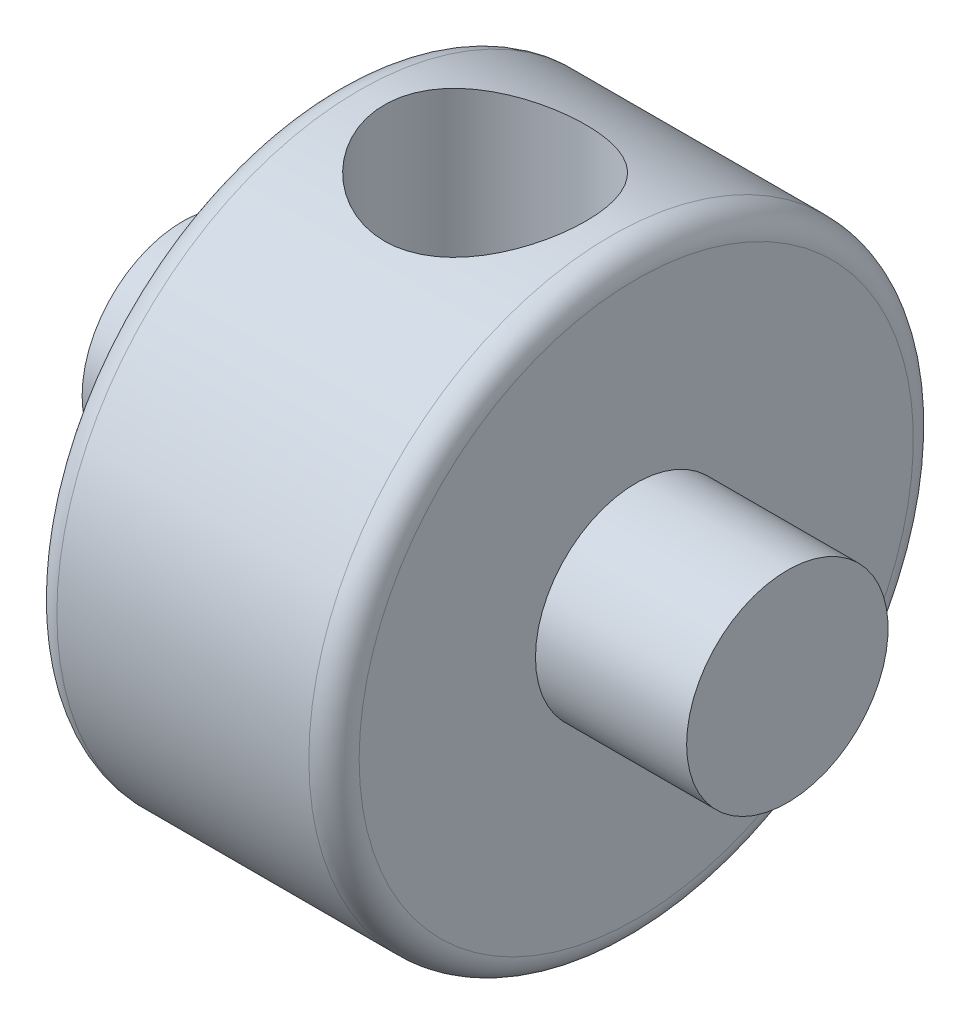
ISO-10303-21;
HEADER;
FILE_DESCRIPTION(('STEP AP214'),'2;1');
FILE_NAME('part.step','',(''),(''),'','','');
FILE_SCHEMA(('AUTOMOTIVE_DESIGN { 1 0 10303 214 1 1 1 1 }'));
ENDSEC;
DATA;
#1=APPLICATION_CONTEXT('core data for automotive mechanical design processes');
#2=APPLICATION_PROTOCOL_DEFINITION('international standard','automotive_design',2000,#1);
#3=PRODUCT_CONTEXT('',#1,'mechanical');
#4=PRODUCT('Part','Part','',(#3));
#5=PRODUCT_RELATED_PRODUCT_CATEGORY('part','',(#4));
#6=PRODUCT_DEFINITION_FORMATION('','',#4);
#7=PRODUCT_DEFINITION_CONTEXT('part definition',#1,'design');
#8=PRODUCT_DEFINITION('design','',#6,#7);
#9=PRODUCT_DEFINITION_SHAPE('','',#8);
#10=(LENGTH_UNIT() NAMED_UNIT(*) SI_UNIT(.MILLI.,.METRE.));
#11=(NAMED_UNIT(*) PLANE_ANGLE_UNIT() SI_UNIT($,.RADIAN.));
#12=(NAMED_UNIT(*) SI_UNIT($,.STERADIAN.) SOLID_ANGLE_UNIT());
#13=UNCERTAINTY_MEASURE_WITH_UNIT(LENGTH_MEASURE(1.E-05),#10,'distance_accuracy_value','');
#14=(GEOMETRIC_REPRESENTATION_CONTEXT(3) GLOBAL_UNCERTAINTY_ASSIGNED_CONTEXT((#13)) GLOBAL_UNIT_ASSIGNED_CONTEXT((#10,
#11,#12)) REPRESENTATION_CONTEXT('',''));
#15=CARTESIAN_POINT('',(0.,0.,0.));
#16=DIRECTION('',(0.,0.,1.));
#17=DIRECTION('',(1.,0.,0.));
#18=AXIS2_PLACEMENT_3D('',#15,#16,#17);
#19=CARTESIAN_POINT('',(-9.52499999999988,0.,0.));
#20=DIRECTION('',(1.,0.,0.));
#21=DIRECTION('',(0.,0.,-1.));
#22=AXIS2_PLACEMENT_3D('',#19,#20,#21);
#23=PLANE('',#22);
#24=CARTESIAN_POINT('',(-9.52499999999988,0.,0.));
#25=DIRECTION('',(-1.,0.,0.));
#26=DIRECTION('',(0.,0.,1.));
#27=AXIS2_PLACEMENT_3D('',#24,#25,#26);
#28=CIRCLE('',#27,3.175);
#29=CARTESIAN_POINT('',(-9.52499999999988,0.,3.175));
#30=VERTEX_POINT('',#29);
#31=EDGE_CURVE('E112',#30,#30,#28,.T.);
#32=ORIENTED_EDGE('',*,*,#31,.T.);
#33=EDGE_LOOP('',(#32));
#34=FACE_BOUND('',#33,.T.);
#35=ADVANCED_FACE('F36',(#34),#23,.F.);
#36=CARTESIAN_POINT('',(-58.3897157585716,0.,-1.2490009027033E-13));
#37=DIRECTION('',(-1.,0.,0.));
#38=DIRECTION('',(0.,0.,1.));
#39=AXIS2_PLACEMENT_3D('',#36,#37,#38);
#40=CYLINDRICAL_SURFACE('',#39,3.175);
#41=ORIENTED_EDGE('',*,*,#31,.F.);
#42=EDGE_LOOP('',(#41));
#43=FACE_BOUND('',#42,.T.);
#44=CARTESIAN_POINT('',(-4.76249999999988,0.,0.));
#45=DIRECTION('',(-1.,0.,0.));
#46=DIRECTION('',(0.,0.,1.));
#47=AXIS2_PLACEMENT_3D('',#44,#45,#46);
#48=CIRCLE('',#47,3.175);
#49=CARTESIAN_POINT('',(-4.76249999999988,0.,3.175));
#50=VERTEX_POINT('',#49);
#51=EDGE_CURVE('E116',#50,#50,#48,.T.);
#52=ORIENTED_EDGE('',*,*,#51,.T.);
#53=EDGE_LOOP('',(#52));
#54=FACE_BOUND('',#53,.T.);
#55=ADVANCED_FACE('F89',(#43,#54),#40,.T.);
#56=CARTESIAN_POINT('',(-4.76249999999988,3.17500000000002,0.));
#57=DIRECTION('',(1.,0.,0.));
#58=DIRECTION('',(0.,0.,-1.));
#59=AXIS2_PLACEMENT_3D('',#56,#57,#58);
#60=PLANE('',#59);
#61=CARTESIAN_POINT('',(-4.76249999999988,0.,0.));
#62=DIRECTION('',(1.,0.,0.));
#63=DIRECTION('',(0.,0.,-1.));
#64=AXIS2_PLACEMENT_3D('',#61,#62,#63);
#65=CIRCLE('',#64,8.73252);
#66=CARTESIAN_POINT('',(-4.76249999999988,0.,-8.73252));
#67=VERTEX_POINT('',#66);
#68=EDGE_CURVE('E109',#67,#67,#65,.F.);
#69=ORIENTED_EDGE('',*,*,#68,.T.);
#70=EDGE_LOOP('',(#69));
#71=FACE_BOUND('',#70,.T.);
#72=ORIENTED_EDGE('',*,*,#51,.F.);
#73=EDGE_LOOP('',(#72));
#74=FACE_BOUND('',#73,.T.);
#75=ADVANCED_FACE('F86',(#71,#74),#60,.F.);
#76=CARTESIAN_POINT('',(-58.3897157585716,0.,-1.2490009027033E-13));
#77=DIRECTION('',(-1.,0.,0.));
#78=DIRECTION('',(0.,0.,1.));
#79=AXIS2_PLACEMENT_3D('',#76,#77,#78);
#80=CYLINDRICAL_SURFACE('',#79,9.525);
#81=CARTESIAN_POINT('',(-3.17499999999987,-9.52500000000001,0.));
#82=CARTESIAN_POINT('',(-3.17500080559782,-9.52500048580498,0.17323867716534));
#83=CARTESIAN_POINT('',(-3.16077515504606,-9.52023018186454,0.346472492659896));
#84=CARTESIAN_POINT('',(-3.10442257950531,-9.50167042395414,0.687837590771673));
#85=CARTESIAN_POINT('',(-3.06229275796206,-9.48788003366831,0.855968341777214));
#86=CARTESIAN_POINT('',(-2.9517364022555,-9.45277852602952,1.18215660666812));
#87=CARTESIAN_POINT('',(-2.88335382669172,-9.43147998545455,1.34023044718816));
#88=CARTESIAN_POINT('',(-2.72243177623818,-9.38353615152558,1.64266542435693));
#89=CARTESIAN_POINT('',(-2.62988753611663,-9.35688980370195,1.7870238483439));
#90=CARTESIAN_POINT('',(-2.41990306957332,-9.30002249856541,2.06292981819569));
#91=CARTESIAN_POINT('',(-2.30177583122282,-9.26971591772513,2.19393674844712));
#92=CARTESIAN_POINT('',(-2.04543928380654,-9.20941499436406,2.43469379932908));
#93=CARTESIAN_POINT('',(-1.90722556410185,-9.17942072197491,2.544439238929));
#94=CARTESIAN_POINT('',(-1.60977225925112,-9.12219830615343,2.74264419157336));
#95=CARTESIAN_POINT('',(-1.4500423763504,-9.09507449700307,2.83040092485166));
#96=CARTESIAN_POINT('',(-1.11704090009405,-9.04796594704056,2.9775749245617));
#97=CARTESIAN_POINT('',(-0.943773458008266,-9.02797902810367,3.037000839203));
#98=CARTESIAN_POINT('',(-0.594762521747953,-8.99830887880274,3.12379824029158));
#99=CARTESIAN_POINT('',(-0.419299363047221,-8.98830104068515,3.15218269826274));
#100=CARTESIAN_POINT('',(-0.0658375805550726,-8.97876209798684,3.17925806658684));
#101=CARTESIAN_POINT('',(0.112160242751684,-8.97922775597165,3.17795815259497));
#102=CARTESIAN_POINT('',(0.456998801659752,-8.99029872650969,3.14648819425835));
#103=CARTESIAN_POINT('',(0.623977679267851,-9.00043970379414,3.11764017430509));
#104=CARTESIAN_POINT('',(0.950574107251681,-9.02895888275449,3.03404956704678));
#105=CARTESIAN_POINT('',(1.11019077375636,-9.04733807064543,2.97930387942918));
#106=CARTESIAN_POINT('',(1.42053547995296,-9.09059367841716,2.84460650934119));
#107=CARTESIAN_POINT('',(1.57107898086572,-9.11556996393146,2.76426310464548));
#108=CARTESIAN_POINT('',(1.8569651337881,-9.16916373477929,2.58092291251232));
#109=CARTESIAN_POINT('',(1.99230337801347,-9.19778227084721,2.4779195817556));
#110=CARTESIAN_POINT('',(2.25136582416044,-9.25726270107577,2.245834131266));
#111=CARTESIAN_POINT('',(2.37411480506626,-9.28816371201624,2.11567125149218));
#112=CARTESIAN_POINT('',(2.59629677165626,-9.3474202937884,1.83622813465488));
#113=CARTESIAN_POINT('',(2.69572752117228,-9.37577562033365,1.68694606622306));
#114=CARTESIAN_POINT('',(2.86923575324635,-9.42711817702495,1.37143367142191));
#115=CARTESIAN_POINT('',(2.94305193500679,-9.45004936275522,1.20504990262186));
#116=CARTESIAN_POINT('',(3.06134507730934,-9.48755300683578,0.861279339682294));
#117=CARTESIAN_POINT('',(3.1058322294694,-9.50212836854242,0.683896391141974));
#118=CARTESIAN_POINT('',(3.162476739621,-9.52079715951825,0.331418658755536));
#119=CARTESIAN_POINT('',(3.17595189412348,-9.52531755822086,0.156557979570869));
#120=CARTESIAN_POINT('',(3.17394376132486,-9.52464766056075,-0.192960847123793));
#121=CARTESIAN_POINT('',(3.1584653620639,-9.51945900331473,-0.367619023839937));
#122=CARTESIAN_POINT('',(3.10003219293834,-9.50023578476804,-0.706500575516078));
#123=CARTESIAN_POINT('',(3.05788629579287,-9.48646180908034,-0.870879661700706));
#124=CARTESIAN_POINT('',(2.94832581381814,-9.45171613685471,-1.19016766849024));
#125=CARTESIAN_POINT('',(2.88090800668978,-9.43074352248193,-1.34507537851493));
#126=CARTESIAN_POINT('',(2.72075137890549,-9.38304356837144,-1.64556534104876));
#127=CARTESIAN_POINT('',(2.62739316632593,-9.35617936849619,-1.79079512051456));
#128=CARTESIAN_POINT('',(2.4187335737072,-9.29974181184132,-2.0639558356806));
#129=CARTESIAN_POINT('',(2.30342549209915,-9.27016762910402,-2.19188146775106));
#130=CARTESIAN_POINT('',(2.0479424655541,-9.20993992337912,-2.43285171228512));
#131=CARTESIAN_POINT('',(1.90687570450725,-9.17929841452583,-2.54495607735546));
#132=CARTESIAN_POINT('',(1.60727527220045,-9.12177415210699,-2.74401763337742));
#133=CARTESIAN_POINT('',(1.44874145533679,-9.09489142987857,-2.83097461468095));
#134=CARTESIAN_POINT('',(1.11863817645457,-9.04819093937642,-2.97687025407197));
#135=CARTESIAN_POINT('',(0.947095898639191,-9.02835890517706,-3.03586556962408));
#136=CARTESIAN_POINT('',(0.595697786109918,-8.99829392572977,-3.12386556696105));
#137=CARTESIAN_POINT('',(0.415845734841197,-8.98805665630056,-3.15288375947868));
#138=CARTESIAN_POINT('',(0.0628742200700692,-8.97883201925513,-3.1790521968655));
#139=CARTESIAN_POINT('',(-0.110116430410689,-8.97929370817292,-3.17776306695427));
#140=CARTESIAN_POINT('',(-0.453279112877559,-8.99005281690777,-3.14719428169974));
#141=CARTESIAN_POINT('',(-0.623451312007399,-9.00034965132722,-3.11791629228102));
#142=CARTESIAN_POINT('',(-0.952930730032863,-9.02920864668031,-3.03330550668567));
#143=CARTESIAN_POINT('',(-1.11238291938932,-9.04761011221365,-2.97847812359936));
#144=CARTESIAN_POINT('',(-1.41994701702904,-9.09054566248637,-2.8447344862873));
#145=CARTESIAN_POINT('',(-1.56805639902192,-9.11508110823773,-2.76581288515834));
#146=CARTESIAN_POINT('',(-1.85573565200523,-9.16885482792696,-2.58210269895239));
#147=CARTESIAN_POINT('',(-1.9946508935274,-9.19825159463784,-2.47633567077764));
#148=CARTESIAN_POINT('',(-2.25326515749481,-9.25777156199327,-2.24359115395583));
#149=CARTESIAN_POINT('',(-2.37295872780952,-9.28789496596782,-2.11660766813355));
#150=CARTESIAN_POINT('',(-2.59443350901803,-9.34688346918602,-1.83909194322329));
#151=CARTESIAN_POINT('',(-2.69533480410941,-9.37565377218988,-1.68783480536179));
#152=CARTESIAN_POINT('',(-2.87016961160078,-9.42740021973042,-1.36955960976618));
#153=CARTESIAN_POINT('',(-2.94411001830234,-9.45037784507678,-1.2025455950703));
#154=CARTESIAN_POINT('',(-3.05981618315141,-9.48707510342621,-0.865167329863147));
#155=CARTESIAN_POINT('',(-3.10287183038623,-9.50116249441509,-0.695286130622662));
#156=CARTESIAN_POINT('',(-3.16045939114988,-9.52012342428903,-0.350267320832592));
#157=CARTESIAN_POINT('',(-3.17499918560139,-9.52499950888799,-0.175131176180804));
#158=CARTESIAN_POINT('',(-3.17499999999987,-9.52500000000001,0.));
#159=B_SPLINE_CURVE_WITH_KNOTS('',3,(#81,#82,#83,#84,#85,#86,#87,#88,#89,#90,#91,#92,#93,#94,
#95,#96,#97,#98,#99,#100,#101,#102,#103,#104,#105,#106,#107,#108,#109,#110,#111,#112,#113,#114,
#115,#116,#117,#118,#119,#120,#121,#122,#123,#124,#125,#126,#127,#128,#129,#130,#131,#132,#133,
#134,#135,#136,#137,#138,#139,#140,#141,#142,#143,#144,#145,#146,#147,#148,#149,#150,#151,#152,
#153,#154,#155,#156,#157,#158),.UNSPECIFIED.,.T.,.F.,(4,2,2,2,2,2,2,2,2,2,2,2,2,2,2,2,2,2,2,2,2,
2,2,2,2,2,2,2,2,2,2,2,2,2,2,2,2,2,4),(0.,0.519071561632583,1.03819701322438,1.55645698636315,
2.07481924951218,2.60936372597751,3.14402575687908,3.69406121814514,4.24392866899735,
4.7752611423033,5.30642937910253,5.81332424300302,6.32027980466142,6.83539943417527,
7.35066800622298,7.89283745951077,8.43505888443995,8.98265937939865,9.53006948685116,
10.0537512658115,10.5773446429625,11.0857715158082,11.5942632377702,12.1161301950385,
12.638156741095,13.1839024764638,13.729652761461,14.2742924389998,14.8186865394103,
15.3351123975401,15.8515075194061,16.3580948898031,16.8647947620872,17.3936046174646,
17.9225642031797,18.4721392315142,19.0215736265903,19.5464607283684,20.0712027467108),.UNSPECIFIED.);
#160=CARTESIAN_POINT('',(-3.17499999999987,-9.52500000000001,0.));
#161=VERTEX_POINT('',#160);
#162=EDGE_CURVE('E10',#161,#161,#159,.T.);
#163=ORIENTED_EDGE('',*,*,#162,.T.);
#164=EDGE_LOOP('',(#163));
#165=FACE_BOUND('',#164,.T.);
#166=CARTESIAN_POINT('',(0.,8.98025612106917,3.175));
#167=CARTESIAN_POINT('',(-0.172936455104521,8.98025555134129,3.17500081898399));
#168=CARTESIAN_POINT('',(-0.345867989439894,8.98530617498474,3.16082293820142));
#169=CARTESIAN_POINT('',(-0.686607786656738,9.00485797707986,3.10467734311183));
#170=CARTESIAN_POINT('',(-0.854415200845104,9.01936071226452,3.0627050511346));
#171=CARTESIAN_POINT('',(-1.17991538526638,9.05599546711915,2.95260866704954));
#172=CARTESIAN_POINT('',(-1.33762727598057,9.07811252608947,2.88453582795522));
#173=CARTESIAN_POINT('',(-1.63944315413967,9.12746212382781,2.7243456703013));
#174=CARTESIAN_POINT('',(-1.78354412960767,9.15469579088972,2.63222304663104));
#175=CARTESIAN_POINT('',(-2.05968588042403,9.2124050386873,2.42268738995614));
#176=CARTESIAN_POINT('',(-2.19111648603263,9.24296141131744,2.30449228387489));
#177=CARTESIAN_POINT('',(-2.4327065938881,9.30319020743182,2.04783584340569));
#178=CARTESIAN_POINT('',(-2.54286268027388,9.33286248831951,1.90937126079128));
#179=CARTESIAN_POINT('',(-2.74154549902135,9.3889152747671,1.61164431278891));
#180=CARTESIAN_POINT('',(-2.82943290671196,9.41518969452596,1.45193356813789));
#181=CARTESIAN_POINT('',(-2.97685328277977,9.46053437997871,1.11896913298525));
#182=CARTESIAN_POINT('',(-3.03639389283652,9.47960658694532,0.945719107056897));
#183=CARTESIAN_POINT('',(-3.12336133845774,9.50782564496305,0.596991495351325));
#184=CARTESIAN_POINT('',(-3.15183344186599,9.51729474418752,0.421801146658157));
#185=CARTESIAN_POINT('',(-3.17917923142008,9.52638456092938,0.0688907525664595));
#186=CARTESIAN_POINT('',(-3.17806054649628,9.52600781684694,-0.108828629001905));
#187=CARTESIAN_POINT('',(-3.14691949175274,9.51566675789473,-0.454353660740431));
#188=CARTESIAN_POINT('',(-3.11803247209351,9.50607905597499,-0.622274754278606));
#189=CARTESIAN_POINT('',(-3.034052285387,9.4788662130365,-0.950732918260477));
#190=CARTESIAN_POINT('',(-2.97895734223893,9.46124052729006,-1.11126948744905));
#191=CARTESIAN_POINT('',(-2.84346231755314,9.41945253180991,-1.42288410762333));
#192=CARTESIAN_POINT('',(-2.76273914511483,9.39520735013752,-1.57381010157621));
#193=CARTESIAN_POINT('',(-2.57854543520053,9.34270397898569,-1.86030973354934));
#194=CARTESIAN_POINT('',(-2.47506857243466,9.31444467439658,-1.99587908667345));
#195=CARTESIAN_POINT('',(-2.24258380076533,9.25532159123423,-2.25457025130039));
#196=CARTESIAN_POINT('',(-2.11260322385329,9.22439783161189,-2.37680549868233));
#197=CARTESIAN_POINT('',(-1.83372529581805,9.16455289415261,-2.59803029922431));
#198=CARTESIAN_POINT('',(-1.68482503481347,9.13563202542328,-2.6970162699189));
#199=CARTESIAN_POINT('',(-1.36952473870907,9.08273917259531,-2.87016016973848));
#200=CARTESIAN_POINT('',(-1.20290548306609,9.05884361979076,-2.94394402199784));
#201=CARTESIAN_POINT('',(-0.858610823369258,9.01959241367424,-3.06210713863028));
#202=CARTESIAN_POINT('',(-0.680940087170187,9.00423318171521,-3.1064987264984));
#203=CARTESIAN_POINT('',(-0.328173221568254,8.98460345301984,-3.16281207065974));
#204=CARTESIAN_POINT('',(-0.153322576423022,8.97986394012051,-3.17610837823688));
#205=CARTESIAN_POINT('',(0.196139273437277,8.98069933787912,-3.17374726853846));
#206=CARTESIAN_POINT('',(0.370750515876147,8.98627237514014,-3.158095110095));
#207=CARTESIAN_POINT('',(0.708523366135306,9.00663737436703,-3.09951644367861));
#208=CARTESIAN_POINT('',(0.871872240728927,9.0211060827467,-3.05754530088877));
#209=CARTESIAN_POINT('',(1.18917594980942,9.05727657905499,-2.94866651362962));
#210=CARTESIAN_POINT('',(1.34312911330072,9.07897964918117,-2.88175444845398));
#211=CARTESIAN_POINT('',(1.64268283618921,9.12802586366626,-2.72248103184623));
#212=CARTESIAN_POINT('',(1.78786359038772,9.15552606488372,-2.62937980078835));
#213=CARTESIAN_POINT('',(2.06103871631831,9.21276315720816,-2.42120937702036));
#214=CARTESIAN_POINT('',(2.18902800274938,9.24250070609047,-2.30613370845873));
#215=CARTESIAN_POINT('',(2.43055134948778,9.30259247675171,-2.05070616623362));
#216=CARTESIAN_POINT('',(2.54309368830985,9.33290753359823,-1.90940458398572));
#217=CARTESIAN_POINT('',(2.74293375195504,9.38932753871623,-1.60917665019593));
#218=CARTESIAN_POINT('',(2.83023237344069,9.41543263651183,-1.45025092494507));
#219=CARTESIAN_POINT('',(2.97630883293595,9.46036988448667,-1.12007606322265));
#220=CARTESIAN_POINT('',(3.03527230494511,9.47924920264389,-0.948915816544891));
#221=CARTESIAN_POINT('',(3.12333558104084,9.50781089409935,-0.598355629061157));
#222=CARTESIAN_POINT('',(3.1524461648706,9.5174965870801,-0.418958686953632));
#223=CARTESIAN_POINT('',(3.1790070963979,9.52632915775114,-0.0660886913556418));
#224=CARTESIAN_POINT('',(3.17788116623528,9.5259499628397,0.107266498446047));
#225=CARTESIAN_POINT('',(3.14751304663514,9.5158622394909,0.451202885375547));
#226=CARTESIAN_POINT('',(3.11827313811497,9.50615446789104,0.621784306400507));
#227=CARTESIAN_POINT('',(3.03345140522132,9.47867404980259,0.952633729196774));
#228=CARTESIAN_POINT('',(2.9782953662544,9.46103195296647,1.11302251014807));
#229=CARTESIAN_POINT('',(2.84360133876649,9.41949985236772,1.4223312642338));
#230=CARTESIAN_POINT('',(2.76405893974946,9.39560871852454,1.57124915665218));
#231=CARTESIAN_POINT('',(2.57946679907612,9.34294133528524,1.85938800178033));
#232=CARTESIAN_POINT('',(2.47358317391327,9.31401720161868,1.99804734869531));
#233=CARTESIAN_POINT('',(2.24073278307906,9.25490239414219,2.25609475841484));
#234=CARTESIAN_POINT('',(2.11375929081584,9.22471131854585,2.37547664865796));
#235=CARTESIAN_POINT('',(1.83639029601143,9.16505913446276,2.59633024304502));
#236=CARTESIAN_POINT('',(1.68527250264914,9.13567286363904,2.69691791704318));
#237=CARTESIAN_POINT('',(1.36736319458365,9.08241113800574,2.87119803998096));
#238=CARTESIAN_POINT('',(1.20057578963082,9.05853424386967,2.94489751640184));
#239=CARTESIAN_POINT('',(0.863721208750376,9.02021736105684,3.06020415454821));
#240=CARTESIAN_POINT('',(0.694143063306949,9.00539959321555,3.1031113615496));
#241=CARTESIAN_POINT('',(0.3497070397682,8.98542092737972,3.1605039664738));
#242=CARTESIAN_POINT('',(0.174851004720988,8.98025669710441,3.17499917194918));
#243=CARTESIAN_POINT('',(0.,8.98025612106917,3.175));
#244=B_SPLINE_CURVE_WITH_KNOTS('',3,(#166,#167,#168,#169,#170,#171,#172,#173,#174,#175,#176,
#177,#178,#179,#180,#181,#182,#183,#184,#185,#186,#187,#188,#189,#190,#191,#192,#193,#194,#195,
#196,#197,#198,#199,#200,#201,#202,#203,#204,#205,#206,#207,#208,#209,#210,#211,#212,#213,#214,
#215,#216,#217,#218,#219,#220,#221,#222,#223,#224,#225,#226,#227,#228,#229,#230,#231,#232,#233,
#234,#235,#236,#237,#238,#239,#240,#241,#242,#243),.UNSPECIFIED.,.T.,.F.,(4,2,2,2,2,2,2,2,2,2,2,
2,2,2,2,2,2,2,2,2,2,2,2,2,2,2,2,2,2,2,2,2,2,2,2,2,2,2,4),(0.,0.518161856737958,1.03640907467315,
1.55364379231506,2.07099270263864,2.60671746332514,3.14252816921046,3.69231882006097,
4.24196117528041,4.77247962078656,5.30286129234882,5.81244090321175,6.32205505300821,
6.83836754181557,7.35482374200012,7.89559553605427,8.43645060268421,8.98501631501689,
9.53335188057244,10.0569487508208,10.5804505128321,11.0859695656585,11.5915782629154,
12.1132237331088,12.6350231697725,13.1819271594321,13.7288117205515,14.2720628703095,
14.815117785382,15.3326491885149,15.8501386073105,16.3594083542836,16.8687702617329,
17.39695274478,17.9253040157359,18.4743376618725,19.0232277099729,19.5473069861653,
20.0712053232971),.UNSPECIFIED.);
#245=CARTESIAN_POINT('',(0.,8.98025612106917,3.175));
#246=VERTEX_POINT('',#245);
#247=EDGE_CURVE('E48',#246,#246,#244,.T.);
#248=ORIENTED_EDGE('',*,*,#247,.T.);
#249=EDGE_LOOP('',(#248));
#250=FACE_BOUND('',#249,.T.);
#251=CARTESIAN_POINT('',(-3.97001999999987,0.,0.));
#252=DIRECTION('',(1.,0.,0.));
#253=DIRECTION('',(0.,0.,-1.));
#254=AXIS2_PLACEMENT_3D('',#251,#252,#253);
#255=CIRCLE('',#254,9.525);
#256=CARTESIAN_POINT('',(-3.97001999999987,0.,-9.525));
#257=VERTEX_POINT('',#256);
#258=EDGE_CURVE('E56',#257,#257,#255,.T.);
#259=ORIENTED_EDGE('',*,*,#258,.T.);
#260=EDGE_LOOP('',(#259));
#261=FACE_BOUND('',#260,.T.);
#262=CARTESIAN_POINT('',(3.97001999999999,0.,0.));
#263=DIRECTION('',(-1.,0.,0.));
#264=DIRECTION('',(0.,0.,1.));
#265=AXIS2_PLACEMENT_3D('',#262,#263,#264);
#266=CIRCLE('',#265,9.525);
#267=CARTESIAN_POINT('',(3.97001999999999,0.,9.525));
#268=VERTEX_POINT('',#267);
#269=EDGE_CURVE('E111',#268,#268,#266,.T.);
#270=ORIENTED_EDGE('',*,*,#269,.T.);
#271=EDGE_LOOP('',(#270));
#272=FACE_BOUND('',#271,.T.);
#273=ADVANCED_FACE('F62',(#165,#250,#261,#272),#80,.T.);
#274=CARTESIAN_POINT('',(4.7625,9.52499999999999,-1.2490009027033E-13));
#275=DIRECTION('',(-1.,0.,0.));
#276=DIRECTION('',(0.,0.,1.));
#277=AXIS2_PLACEMENT_3D('',#274,#275,#276);
#278=PLANE('',#277);
#279=CARTESIAN_POINT('',(4.7625,0.,0.));
#280=DIRECTION('',(-1.,0.,0.));
#281=DIRECTION('',(0.,0.,1.));
#282=AXIS2_PLACEMENT_3D('',#279,#280,#281);
#283=CIRCLE('',#282,8.73252);
#284=CARTESIAN_POINT('',(4.7625,0.,8.73252));
#285=VERTEX_POINT('',#284);
#286=EDGE_CURVE('E52',#285,#285,#283,.F.);
#287=ORIENTED_EDGE('',*,*,#286,.T.);
#288=EDGE_LOOP('',(#287));
#289=FACE_BOUND('',#288,.T.);
#290=CARTESIAN_POINT('',(4.7625,0.,0.));
#291=DIRECTION('',(-1.,0.,0.));
#292=DIRECTION('',(0.,0.,1.));
#293=AXIS2_PLACEMENT_3D('',#290,#291,#292);
#294=CIRCLE('',#293,3.175);
#295=CARTESIAN_POINT('',(4.7625,0.,3.175));
#296=VERTEX_POINT('',#295);
#297=EDGE_CURVE('E125',#296,#296,#294,.T.);
#298=ORIENTED_EDGE('',*,*,#297,.T.);
#299=EDGE_LOOP('',(#298));
#300=FACE_BOUND('',#299,.T.);
#301=ADVANCED_FACE('F79',(#289,#300),#278,.F.);
#302=CARTESIAN_POINT('',(-58.3897157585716,0.,-1.2490009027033E-13));
#303=DIRECTION('',(-1.,0.,0.));
#304=DIRECTION('',(0.,0.,1.));
#305=AXIS2_PLACEMENT_3D('',#302,#303,#304);
#306=CYLINDRICAL_SURFACE('',#305,3.175);
#307=ORIENTED_EDGE('',*,*,#297,.F.);
#308=EDGE_LOOP('',(#307));
#309=FACE_BOUND('',#308,.T.);
#310=CARTESIAN_POINT('',(9.52500000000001,0.,0.));
#311=DIRECTION('',(-1.,0.,0.));
#312=DIRECTION('',(0.,0.,1.));
#313=AXIS2_PLACEMENT_3D('',#310,#311,#312);
#314=CIRCLE('',#313,3.175);
#315=CARTESIAN_POINT('',(9.52500000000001,0.,3.175));
#316=VERTEX_POINT('',#315);
#317=EDGE_CURVE('E128',#316,#316,#314,.T.);
#318=ORIENTED_EDGE('',*,*,#317,.T.);
#319=EDGE_LOOP('',(#318));
#320=FACE_BOUND('',#319,.T.);
#321=ADVANCED_FACE('F76',(#309,#320),#306,.T.);
#322=CARTESIAN_POINT('',(9.52500000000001,3.17500000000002,0.));
#323=DIRECTION('',(-1.,0.,0.));
#324=DIRECTION('',(0.,0.,1.));
#325=AXIS2_PLACEMENT_3D('',#322,#323,#324);
#326=PLANE('',#325);
#327=ORIENTED_EDGE('',*,*,#317,.F.);
#328=EDGE_LOOP('',(#327));
#329=FACE_BOUND('',#328,.T.);
#330=ADVANCED_FACE('F71',(#329),#326,.F.);
#331=CARTESIAN_POINT('',(-3.97001999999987,0.,0.));
#332=DIRECTION('',(1.,0.,0.));
#333=DIRECTION('',(0.,0.,-1.));
#334=AXIS2_PLACEMENT_3D('',#331,#332,#333);
#335=TOROIDAL_SURFACE('',#334,8.73252,0.79248);
#336=ORIENTED_EDGE('',*,*,#258,.F.);
#337=EDGE_LOOP('',(#336));
#338=FACE_BOUND('',#337,.T.);
#339=ORIENTED_EDGE('',*,*,#68,.F.);
#340=EDGE_LOOP('',(#339));
#341=FACE_BOUND('',#340,.T.);
#342=ADVANCED_FACE('F75',(#338,#341),#335,.T.);
#343=CARTESIAN_POINT('',(3.97001999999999,0.,0.));
#344=DIRECTION('',(-1.,0.,0.));
#345=DIRECTION('',(0.,0.,1.));
#346=AXIS2_PLACEMENT_3D('',#343,#344,#345);
#347=TOROIDAL_SURFACE('',#346,8.73252,0.79248);
#348=ORIENTED_EDGE('',*,*,#286,.F.);
#349=EDGE_LOOP('',(#348));
#350=FACE_BOUND('',#349,.T.);
#351=ORIENTED_EDGE('',*,*,#269,.F.);
#352=EDGE_LOOP('',(#351));
#353=FACE_BOUND('',#352,.T.);
#354=ADVANCED_FACE('F38',(#350,#353),#347,.T.);
#355=CARTESIAN_POINT('',(0.,9.52499999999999,-1.2490009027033E-13));
#356=DIRECTION('',(0.,1.,0.));
#357=DIRECTION('',(0.,0.,1.));
#358=AXIS2_PLACEMENT_3D('',#355,#356,#357);
#359=CYLINDRICAL_SURFACE('',#358,3.175);
#360=ORIENTED_EDGE('',*,*,#247,.F.);
#361=EDGE_LOOP('',(#360));
#362=FACE_BOUND('',#361,.T.);
#363=ORIENTED_EDGE('',*,*,#162,.F.);
#364=EDGE_LOOP('',(#363));
#365=FACE_BOUND('',#364,.T.);
#366=ADVANCED_FACE('F66',(#362,#365),#359,.F.);
#367=CLOSED_SHELL('',(#35,#55,#75,#273,#301,#321,#330,#342,#354,#366));
#368=MANIFOLD_SOLID_BREP('B2',#367);
#369=ADVANCED_BREP_SHAPE_REPRESENTATION('',(#18,#368),#14);
#370=SHAPE_DEFINITION_REPRESENTATION(#9,#369);
ENDSEC;
END-ISO-10303-21;
